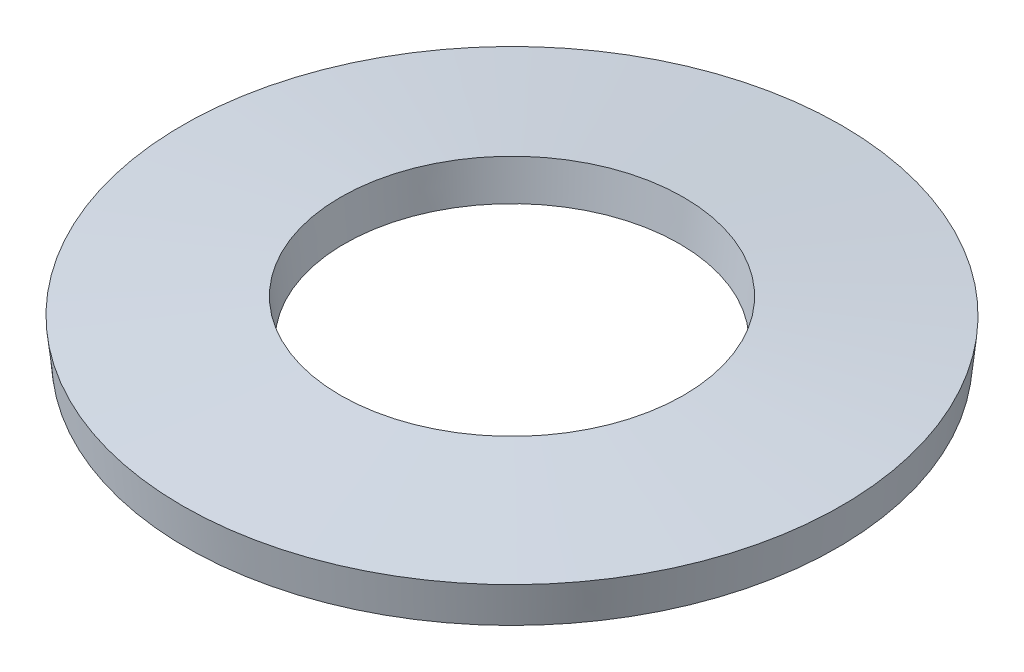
ISO-10303-21;
HEADER;
FILE_DESCRIPTION(('STEP AP214'),'2;1');
FILE_NAME('part.step','',(''),(''),'','','');
FILE_SCHEMA(('AUTOMOTIVE_DESIGN { 1 0 10303 214 1 1 1 1 }'));
ENDSEC;
DATA;
#1=APPLICATION_CONTEXT('core data for automotive mechanical design processes');
#2=APPLICATION_PROTOCOL_DEFINITION('international standard','automotive_design',2000,#1);
#3=PRODUCT_CONTEXT('',#1,'mechanical');
#4=PRODUCT('Part','Part','',(#3));
#5=PRODUCT_RELATED_PRODUCT_CATEGORY('part','',(#4));
#6=PRODUCT_DEFINITION_FORMATION('','',#4);
#7=PRODUCT_DEFINITION_CONTEXT('part definition',#1,'design');
#8=PRODUCT_DEFINITION('design','',#6,#7);
#9=PRODUCT_DEFINITION_SHAPE('','',#8);
#10=(LENGTH_UNIT() NAMED_UNIT(*) SI_UNIT(.MILLI.,.METRE.));
#11=(NAMED_UNIT(*) PLANE_ANGLE_UNIT() SI_UNIT($,.RADIAN.));
#12=(NAMED_UNIT(*) SI_UNIT($,.STERADIAN.) SOLID_ANGLE_UNIT());
#13=UNCERTAINTY_MEASURE_WITH_UNIT(LENGTH_MEASURE(1.E-05),#10,'distance_accuracy_value','');
#14=(GEOMETRIC_REPRESENTATION_CONTEXT(3) GLOBAL_UNCERTAINTY_ASSIGNED_CONTEXT((#13)) GLOBAL_UNIT_ASSIGNED_CONTEXT((#10,
#11,#12)) REPRESENTATION_CONTEXT('',''));
#15=CARTESIAN_POINT('',(0.,0.,0.));
#16=DIRECTION('',(0.,0.,1.));
#17=DIRECTION('',(1.,0.,0.));
#18=AXIS2_PLACEMENT_3D('',#15,#16,#17);
#19=CARTESIAN_POINT('',(0.,3.48063173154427,0.));
#20=DIRECTION('',(0.,-1.,0.));
#21=DIRECTION('',(0.,0.,-1.));
#22=AXIS2_PLACEMENT_3D('',#19,#20,#21);
#23=CONICAL_SURFACE('',#22,30.,1.46554517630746);
#24=CARTESIAN_POINT('',(0.,5.,0.));
#25=DIRECTION('',(0.,-1.,0.));
#26=DIRECTION('',(0.,0.,-1.));
#27=AXIS2_PLACEMENT_3D('',#24,#25,#26);
#28=CIRCLE('',#27,15.6176992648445);
#29=CARTESIAN_POINT('',(0.,5.,-15.6176992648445));
#30=VERTEX_POINT('',#29);
#31=EDGE_CURVE('E10',#30,#30,#28,.T.);
#32=ORIENTED_EDGE('',*,*,#31,.T.);
#33=EDGE_LOOP('',(#32));
#34=FACE_BOUND('',#33,.T.);
#35=CARTESIAN_POINT('',(0.,3.48063173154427,0.));
#36=DIRECTION('',(0.,-1.,0.));
#37=DIRECTION('',(0.,0.,-1.));
#38=AXIS2_PLACEMENT_3D('',#35,#36,#37);
#39=CIRCLE('',#38,30.);
#40=CARTESIAN_POINT('',(0.,3.48063173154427,-30.));
#41=VERTEX_POINT('',#40);
#42=EDGE_CURVE('E44',#41,#41,#39,.T.);
#43=ORIENTED_EDGE('',*,*,#42,.F.);
#44=EDGE_LOOP('',(#43));
#45=FACE_BOUND('',#44,.T.);
#46=ADVANCED_FACE('F30',(#34,#45),#23,.T.);
#47=CARTESIAN_POINT('',(0.,5.,0.));
#48=DIRECTION('',(0.,1.,0.));
#49=DIRECTION('',(0.,0.,1.));
#50=AXIS2_PLACEMENT_3D('',#47,#48,#49);
#51=CONICAL_SURFACE('',#50,15.6176992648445,0.105251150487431);
#52=CARTESIAN_POINT('',(0.,1.51936826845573,0.));
#53=DIRECTION('',(0.,-1.,0.));
#54=DIRECTION('',(0.,0.,-1.));
#55=AXIS2_PLACEMENT_3D('',#52,#53,#54);
#56=CIRCLE('',#55,15.25);
#57=CARTESIAN_POINT('',(0.,1.51936826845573,-15.25));
#58=VERTEX_POINT('',#57);
#59=EDGE_CURVE('E36',#58,#58,#56,.T.);
#60=ORIENTED_EDGE('',*,*,#59,.T.);
#61=EDGE_LOOP('',(#60));
#62=FACE_BOUND('',#61,.T.);
#63=ORIENTED_EDGE('',*,*,#31,.F.);
#64=EDGE_LOOP('',(#63));
#65=FACE_BOUND('',#64,.T.);
#66=ADVANCED_FACE('F54',(#62,#65),#51,.F.);
#67=CARTESIAN_POINT('',(0.,1.51936826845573,0.));
#68=DIRECTION('',(0.,-1.,0.));
#69=DIRECTION('',(0.,0.,-1.));
#70=AXIS2_PLACEMENT_3D('',#67,#68,#69);
#71=CONICAL_SURFACE('',#70,15.25,1.46554517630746);
#72=CARTESIAN_POINT('',(0.,0.,0.));
#73=DIRECTION('',(0.,-1.,0.));
#74=DIRECTION('',(0.,0.,-1.));
#75=AXIS2_PLACEMENT_3D('',#72,#73,#74);
#76=CIRCLE('',#75,29.6323007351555);
#77=CARTESIAN_POINT('',(0.,0.,-29.6323007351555));
#78=VERTEX_POINT('',#77);
#79=EDGE_CURVE('E40',#78,#78,#76,.T.);
#80=ORIENTED_EDGE('',*,*,#79,.T.);
#81=EDGE_LOOP('',(#80));
#82=FACE_BOUND('',#81,.T.);
#83=ORIENTED_EDGE('',*,*,#59,.F.);
#84=EDGE_LOOP('',(#83));
#85=FACE_BOUND('',#84,.T.);
#86=ADVANCED_FACE('F58',(#82,#85),#71,.F.);
#87=CARTESIAN_POINT('',(0.,0.,0.));
#88=DIRECTION('',(0.,1.,0.));
#89=DIRECTION('',(0.,0.,1.));
#90=AXIS2_PLACEMENT_3D('',#87,#88,#89);
#91=CONICAL_SURFACE('',#90,29.6323007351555,0.105251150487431);
#92=ORIENTED_EDGE('',*,*,#42,.T.);
#93=EDGE_LOOP('',(#92));
#94=FACE_BOUND('',#93,.T.);
#95=ORIENTED_EDGE('',*,*,#79,.F.);
#96=EDGE_LOOP('',(#95));
#97=FACE_BOUND('',#96,.T.);
#98=ADVANCED_FACE('F50',(#94,#97),#91,.T.);
#99=CLOSED_SHELL('',(#46,#66,#86,#98));
#100=MANIFOLD_SOLID_BREP('B2',#99);
#101=ADVANCED_BREP_SHAPE_REPRESENTATION('',(#18,#100),#14);
#102=SHAPE_DEFINITION_REPRESENTATION(#9,#101);
ENDSEC;
END-ISO-10303-21;
